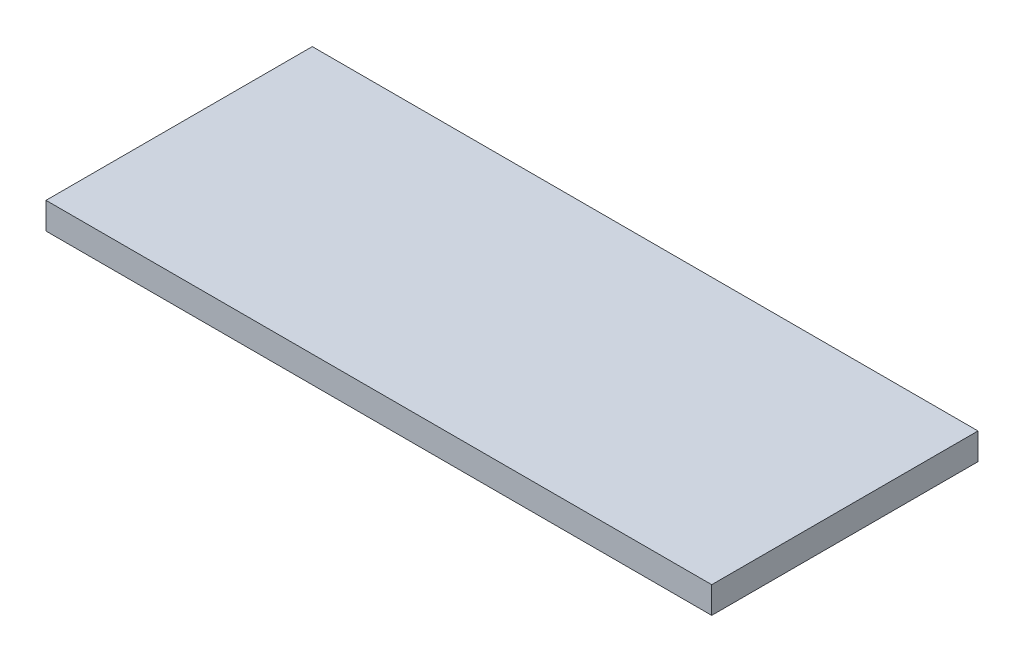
ISO-10303-21;
HEADER;
FILE_DESCRIPTION(('STEP AP214'),'2;1');
FILE_NAME('part.step','',(''),(''),'','','');
FILE_SCHEMA(('AUTOMOTIVE_DESIGN { 1 0 10303 214 1 1 1 1 }'));
ENDSEC;
DATA;
#1=APPLICATION_CONTEXT('core data for automotive mechanical design processes');
#2=APPLICATION_PROTOCOL_DEFINITION('international standard','automotive_design',2000,#1);
#3=PRODUCT_CONTEXT('',#1,'mechanical');
#4=PRODUCT('Part','Part','',(#3));
#5=PRODUCT_RELATED_PRODUCT_CATEGORY('part','',(#4));
#6=PRODUCT_DEFINITION_FORMATION('','',#4);
#7=PRODUCT_DEFINITION_CONTEXT('part definition',#1,'design');
#8=PRODUCT_DEFINITION('design','',#6,#7);
#9=PRODUCT_DEFINITION_SHAPE('','',#8);
#10=(LENGTH_UNIT() NAMED_UNIT(*) SI_UNIT(.MILLI.,.METRE.));
#11=(NAMED_UNIT(*) PLANE_ANGLE_UNIT() SI_UNIT($,.RADIAN.));
#12=(NAMED_UNIT(*) SI_UNIT($,.STERADIAN.) SOLID_ANGLE_UNIT());
#13=UNCERTAINTY_MEASURE_WITH_UNIT(LENGTH_MEASURE(1.E-05),#10,'distance_accuracy_value','');
#14=(GEOMETRIC_REPRESENTATION_CONTEXT(3) GLOBAL_UNCERTAINTY_ASSIGNED_CONTEXT((#13)) GLOBAL_UNIT_ASSIGNED_CONTEXT((#10,
#11,#12)) REPRESENTATION_CONTEXT('',''));
#15=CARTESIAN_POINT('',(0.,0.,0.));
#16=DIRECTION('',(0.,0.,1.));
#17=DIRECTION('',(1.,0.,0.));
#18=AXIS2_PLACEMENT_3D('',#15,#16,#17);
#19=CARTESIAN_POINT('',(-16.5132873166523,0.1,5.50888697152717));
#20=DIRECTION('',(1.,0.,0.));
#21=DIRECTION('',(0.,0.,-1.));
#22=AXIS2_PLACEMENT_3D('',#19,#20,#21);
#23=PLANE('',#22);
#24=DIRECTION('',(0.,0.,1.));
#25=VECTOR('',#24,1.);
#26=CARTESIAN_POINT('',(-16.5132873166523,0.,5.50888697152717));
#27=LINE('',#26,#25);
#28=CARTESIAN_POINT('',(-16.5132873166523,0.,5.50888697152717));
#29=VERTEX_POINT('',#28);
#30=CARTESIAN_POINT('',(-16.5132873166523,0.,6.50888697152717));
#31=VERTEX_POINT('',#30);
#32=EDGE_CURVE('E98',#29,#31,#27,.T.);
#33=ORIENTED_EDGE('',*,*,#32,.T.);
#34=DIRECTION('',(0.,-1.,0.));
#35=VECTOR('',#34,1.);
#36=CARTESIAN_POINT('',(-16.5132873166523,0.1,6.50888697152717));
#37=LINE('',#36,#35);
#38=CARTESIAN_POINT('',(-16.5132873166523,0.1,6.50888697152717));
#39=VERTEX_POINT('',#38);
#40=EDGE_CURVE('E11',#39,#31,#37,.T.);
#41=ORIENTED_EDGE('',*,*,#40,.F.);
#42=DIRECTION('',(0.,0.,1.));
#43=VECTOR('',#42,1.);
#44=CARTESIAN_POINT('',(-16.5132873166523,0.1,5.50888697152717));
#45=LINE('',#44,#43);
#46=CARTESIAN_POINT('',(-16.5132873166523,0.1,5.50888697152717));
#47=VERTEX_POINT('',#46);
#48=EDGE_CURVE('E86',#47,#39,#45,.T.);
#49=ORIENTED_EDGE('',*,*,#48,.F.);
#50=DIRECTION('',(0.,-1.,0.));
#51=VECTOR('',#50,1.);
#52=CARTESIAN_POINT('',(-16.5132873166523,0.1,5.50888697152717));
#53=LINE('',#52,#51);
#54=EDGE_CURVE('E94',#47,#29,#53,.T.);
#55=ORIENTED_EDGE('',*,*,#54,.T.);
#56=EDGE_LOOP('',(#33,#41,#49,#55));
#57=FACE_BOUND('',#56,.T.);
#58=ADVANCED_FACE('F35',(#57),#23,.F.);
#59=CARTESIAN_POINT('',(-16.5132873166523,0.1,6.50888697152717));
#60=DIRECTION('',(0.,0.,-1.));
#61=DIRECTION('',(-1.,0.,0.));
#62=AXIS2_PLACEMENT_3D('',#59,#60,#61);
#63=PLANE('',#62);
#64=DIRECTION('',(1.,0.,0.));
#65=VECTOR('',#64,1.);
#66=CARTESIAN_POINT('',(-16.5132873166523,0.,6.50888697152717));
#67=LINE('',#66,#65);
#68=CARTESIAN_POINT('',(-14.0132873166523,0.,6.50888697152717));
#69=VERTEX_POINT('',#68);
#70=EDGE_CURVE('E90',#31,#69,#67,.T.);
#71=ORIENTED_EDGE('',*,*,#70,.T.);
#72=DIRECTION('',(0.,-1.,0.));
#73=VECTOR('',#72,1.);
#74=CARTESIAN_POINT('',(-14.0132873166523,0.1,6.50888697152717));
#75=LINE('',#74,#73);
#76=CARTESIAN_POINT('',(-14.0132873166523,0.1,6.50888697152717));
#77=VERTEX_POINT('',#76);
#78=EDGE_CURVE('E43',#77,#69,#75,.T.);
#79=ORIENTED_EDGE('',*,*,#78,.F.);
#80=DIRECTION('',(1.,0.,0.));
#81=VECTOR('',#80,1.);
#82=CARTESIAN_POINT('',(-16.5132873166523,0.1,6.50888697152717));
#83=LINE('',#82,#81);
#84=EDGE_CURVE('E81',#39,#77,#83,.T.);
#85=ORIENTED_EDGE('',*,*,#84,.F.);
#86=ORIENTED_EDGE('',*,*,#40,.T.);
#87=EDGE_LOOP('',(#71,#79,#85,#86));
#88=FACE_BOUND('',#87,.T.);
#89=ADVANCED_FACE('F89',(#88),#63,.F.);
#90=CARTESIAN_POINT('',(-14.0132873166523,0.1,5.50888697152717));
#91=DIRECTION('',(-1.,0.,0.));
#92=DIRECTION('',(0.,0.,1.));
#93=AXIS2_PLACEMENT_3D('',#90,#91,#92);
#94=PLANE('',#93);
#95=DIRECTION('',(0.,0.,-1.));
#96=VECTOR('',#95,1.);
#97=CARTESIAN_POINT('',(-14.0132873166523,0.,5.50888697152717));
#98=LINE('',#97,#96);
#99=CARTESIAN_POINT('',(-14.0132873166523,0.,5.50888697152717));
#100=VERTEX_POINT('',#99);
#101=EDGE_CURVE('E68',#69,#100,#98,.T.);
#102=ORIENTED_EDGE('',*,*,#101,.T.);
#103=DIRECTION('',(0.,-1.,0.));
#104=VECTOR('',#103,1.);
#105=CARTESIAN_POINT('',(-14.0132873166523,0.1,5.50888697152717));
#106=LINE('',#105,#104);
#107=CARTESIAN_POINT('',(-14.0132873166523,0.1,5.50888697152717));
#108=VERTEX_POINT('',#107);
#109=EDGE_CURVE('E91',#108,#100,#106,.T.);
#110=ORIENTED_EDGE('',*,*,#109,.F.);
#111=DIRECTION('',(0.,0.,-1.));
#112=VECTOR('',#111,1.);
#113=CARTESIAN_POINT('',(-14.0132873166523,0.1,5.50888697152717));
#114=LINE('',#113,#112);
#115=EDGE_CURVE('E84',#77,#108,#114,.T.);
#116=ORIENTED_EDGE('',*,*,#115,.F.);
#117=ORIENTED_EDGE('',*,*,#78,.T.);
#118=EDGE_LOOP('',(#102,#110,#116,#117));
#119=FACE_BOUND('',#118,.T.);
#120=ADVANCED_FACE('F92',(#119),#94,.F.);
#121=CARTESIAN_POINT('',(-16.5132873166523,0.1,5.50888697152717));
#122=DIRECTION('',(0.,0.,1.));
#123=DIRECTION('',(1.,0.,0.));
#124=AXIS2_PLACEMENT_3D('',#121,#122,#123);
#125=PLANE('',#124);
#126=DIRECTION('',(-1.,0.,0.));
#127=VECTOR('',#126,1.);
#128=CARTESIAN_POINT('',(-16.5132873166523,0.,5.50888697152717));
#129=LINE('',#128,#127);
#130=EDGE_CURVE('E74',#100,#29,#129,.T.);
#131=ORIENTED_EDGE('',*,*,#130,.T.);
#132=ORIENTED_EDGE('',*,*,#54,.F.);
#133=DIRECTION('',(-1.,0.,0.));
#134=VECTOR('',#133,1.);
#135=CARTESIAN_POINT('',(-16.5132873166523,0.1,5.50888697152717));
#136=LINE('',#135,#134);
#137=EDGE_CURVE('E51',#108,#47,#136,.T.);
#138=ORIENTED_EDGE('',*,*,#137,.F.);
#139=ORIENTED_EDGE('',*,*,#109,.T.);
#140=EDGE_LOOP('',(#131,#132,#138,#139));
#141=FACE_BOUND('',#140,.T.);
#142=ADVANCED_FACE('F105',(#141),#125,.F.);
#143=CARTESIAN_POINT('',(-16.5132873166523,0.1,6.50888697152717));
#144=DIRECTION('',(0.,1.,0.));
#145=DIRECTION('',(0.,0.,1.));
#146=AXIS2_PLACEMENT_3D('',#143,#144,#145);
#147=PLANE('',#146);
#148=ORIENTED_EDGE('',*,*,#48,.T.);
#149=ORIENTED_EDGE('',*,*,#84,.T.);
#150=ORIENTED_EDGE('',*,*,#115,.T.);
#151=ORIENTED_EDGE('',*,*,#137,.T.);
#152=EDGE_LOOP('',(#148,#149,#150,#151));
#153=FACE_BOUND('',#152,.T.);
#154=ADVANCED_FACE('F82',(#153),#147,.T.);
#155=CARTESIAN_POINT('',(-16.5132873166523,0.,6.50888697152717));
#156=DIRECTION('',(0.,1.,0.));
#157=DIRECTION('',(0.,0.,1.));
#158=AXIS2_PLACEMENT_3D('',#155,#156,#157);
#159=PLANE('',#158);
#160=ORIENTED_EDGE('',*,*,#32,.F.);
#161=ORIENTED_EDGE('',*,*,#130,.F.);
#162=ORIENTED_EDGE('',*,*,#101,.F.);
#163=ORIENTED_EDGE('',*,*,#70,.F.);
#164=EDGE_LOOP('',(#160,#161,#162,#163));
#165=FACE_BOUND('',#164,.T.);
#166=ADVANCED_FACE('F108',(#165),#159,.F.);
#167=CLOSED_SHELL('',(#58,#89,#120,#142,#154,#166));
#168=MANIFOLD_SOLID_BREP('B2',#167);
#169=ADVANCED_BREP_SHAPE_REPRESENTATION('',(#18,#168),#14);
#170=SHAPE_DEFINITION_REPRESENTATION(#9,#169);
ENDSEC;
END-ISO-10303-21;
